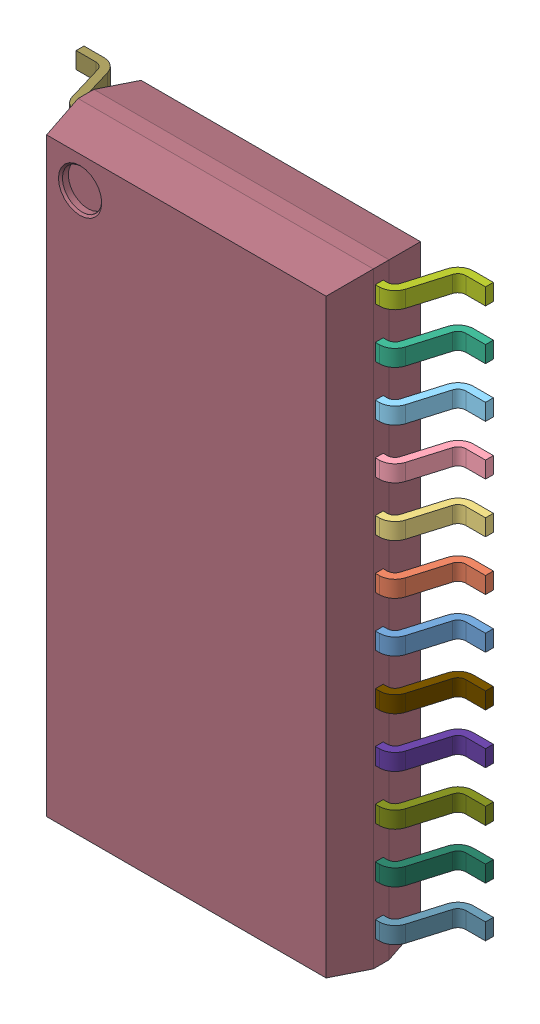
SolidWorks assembly User Library-SOIC_24.sldasm, configuration Default (file format 9000). Lengths in mm.
Overall size (10.4 15.4 2.6).
25 component instances, 25 part files, 0 mates.
Components (placement in the parent):
- User Library-SOIC_24__51-1: User Library-SOIC_24__51.sldprt [Default] at origin size (1.45 0.42 1.55)
- User Library-SOIC_24__51_2-1: User Library-SOIC_24__51_2.sldprt [Default] at origin size (1.45 0.42 1.55)
- User Library-SOIC_24__51_3-1: User Library-SOIC_24__51_3.sldprt [Default] at origin size (1.45 0.42 1.55)
- User Library-SOIC_24__51_4-1: User Library-SOIC_24__51_4.sldprt [Default] at origin size (1.45 0.42 1.55)
- User Library-SOIC_24__51_5-1: User Library-SOIC_24__51_5.sldprt [Default] at origin size (1.45 0.42 1.55)
- User Library-SOIC_24__51_6-1: User Library-SOIC_24__51_6.sldprt [Default] at origin size (1.45 0.42 1.55)
- User Library-SOIC_24__51_7-1: User Library-SOIC_24__51_7.sldprt [Default] at origin size (1.45 0.42 1.55)
- User Library-SOIC_24__51_8-1: User Library-SOIC_24__51_8.sldprt [Default] at origin size (1.45 0.42 1.55)
- User Library-SOIC_24__51_9-1: User Library-SOIC_24__51_9.sldprt [Default] at origin size (1.45 0.42 1.55)
- User Library-SOIC_24__51_10-1: User Library-SOIC_24__51_10.sldprt [Default] at origin size (1.45 0.42 1.55)
- User Library-SOIC_24__51_11-1: User Library-SOIC_24__51_11.sldprt [Default] at origin size (1.45 0.42 1.55)
- User Library-SOIC_24__51_12-1: User Library-SOIC_24__51_12.sldprt [Default] at origin size (1.45 0.42 1.55)
- User Library-SOIC_24__77-1: User Library-SOIC_24__77.sldprt [Default] at origin size (7.5 15.4 2.4)
- User Library-SOIC_24__51_13-1: User Library-SOIC_24__51_13.sldprt [Default] at origin size (1.45 0.42 1.55)
- User Library-SOIC_24__51_14-1: User Library-SOIC_24__51_14.sldprt [Default] at origin size (1.45 0.42 1.55)
- User Library-SOIC_24__51_15-1: User Library-SOIC_24__51_15.sldprt [Default] at origin size (1.45 0.42 1.55)
- User Library-SOIC_24__51_16-1: User Library-SOIC_24__51_16.sldprt [Default] at origin size (1.45 0.42 1.55)
- User Library-SOIC_24__51_17-1: User Library-SOIC_24__51_17.sldprt [Default] at origin size (1.45 0.42 1.55)
- User Library-SOIC_24__51_18-1: User Library-SOIC_24__51_18.sldprt [Default] at origin size (1.45 0.42 1.55)
- User Library-SOIC_24__51_19-1: User Library-SOIC_24__51_19.sldprt [Default] at origin size (1.45 0.42 1.55)
- User Library-SOIC_24__51_20-1: User Library-SOIC_24__51_20.sldprt [Default] at origin size (1.45 0.42 1.55)
- User Library-SOIC_24__51_21-1: User Library-SOIC_24__51_21.sldprt [Default] at origin size (1.45 0.42 1.55)
- User Library-SOIC_24__51_22-1: User Library-SOIC_24__51_22.sldprt [Default] at origin size (1.45 0.42 1.55)
- User Library-SOIC_24__51_23-1: User Library-SOIC_24__51_23.sldprt [Default] at origin size (1.45 0.42 1.55)
- User Library-SOIC_24__51_24-1: User Library-SOIC_24__51_24.sldprt [Default] at origin size (1.45 0.42 1.55)
